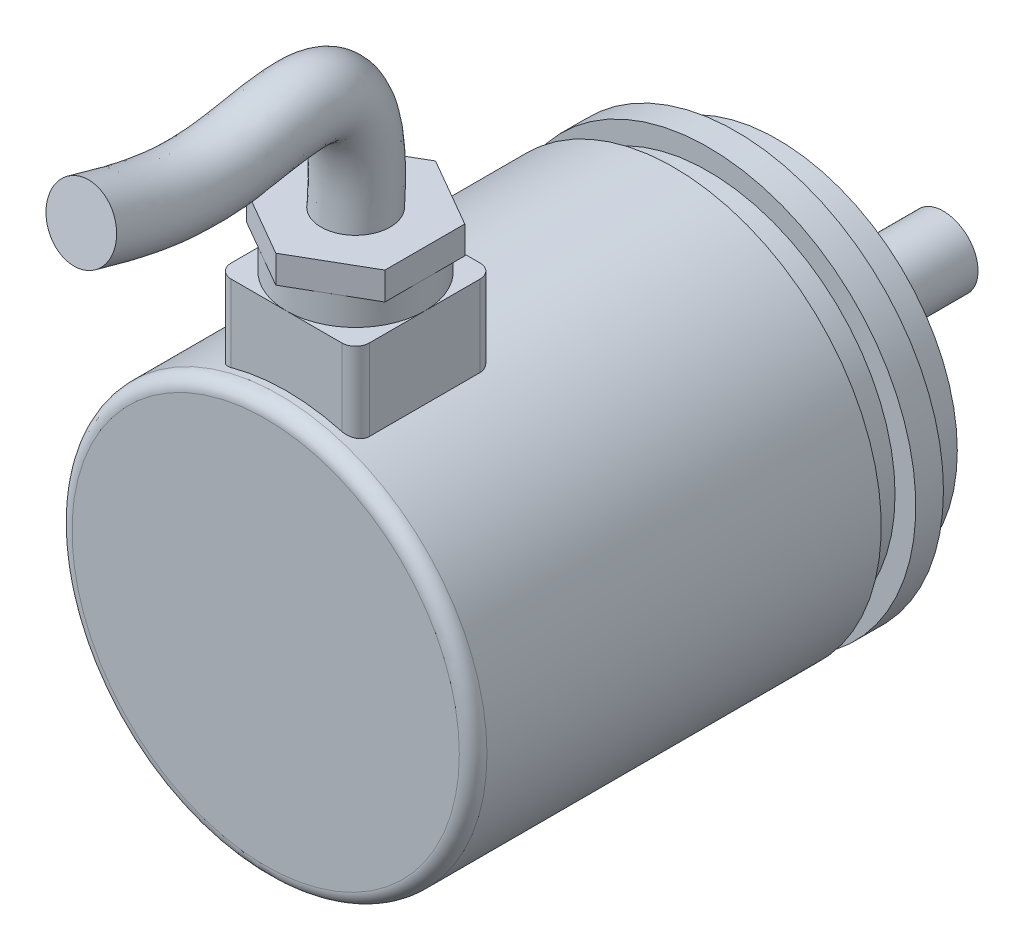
ISO-10303-21;
HEADER;
FILE_DESCRIPTION(('STEP AP214'),'2;1');
FILE_NAME('part.step','',(''),(''),'','','');
FILE_SCHEMA(('AUTOMOTIVE_DESIGN { 1 0 10303 214 1 1 1 1 }'));
ENDSEC;
DATA;
#1=APPLICATION_CONTEXT('core data for automotive mechanical design processes');
#2=APPLICATION_PROTOCOL_DEFINITION('international standard','automotive_design',2000,#1);
#3=PRODUCT_CONTEXT('',#1,'mechanical');
#4=PRODUCT('Part','Part','',(#3));
#5=PRODUCT_RELATED_PRODUCT_CATEGORY('part','',(#4));
#6=PRODUCT_DEFINITION_FORMATION('','',#4);
#7=PRODUCT_DEFINITION_CONTEXT('part definition',#1,'design');
#8=PRODUCT_DEFINITION('design','',#6,#7);
#9=PRODUCT_DEFINITION_SHAPE('','',#8);
#10=(LENGTH_UNIT() NAMED_UNIT(*) SI_UNIT(.MILLI.,.METRE.));
#11=(NAMED_UNIT(*) PLANE_ANGLE_UNIT() SI_UNIT($,.RADIAN.));
#12=(NAMED_UNIT(*) SI_UNIT($,.STERADIAN.) SOLID_ANGLE_UNIT());
#13=UNCERTAINTY_MEASURE_WITH_UNIT(LENGTH_MEASURE(1.E-05),#10,'distance_accuracy_value','');
#14=(GEOMETRIC_REPRESENTATION_CONTEXT(3) GLOBAL_UNCERTAINTY_ASSIGNED_CONTEXT((#13)) GLOBAL_UNIT_ASSIGNED_CONTEXT((#10,
#11,#12)) REPRESENTATION_CONTEXT('',''));
#15=CARTESIAN_POINT('',(0.,0.,0.));
#16=DIRECTION('',(0.,0.,1.));
#17=DIRECTION('',(1.,0.,0.));
#18=AXIS2_PLACEMENT_3D('',#15,#16,#17);
#19=CARTESIAN_POINT('',(2.78567965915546E-13,0.,34.));
#20=DIRECTION('',(0.,0.,-1.));
#21=DIRECTION('',(-1.,0.,0.));
#22=AXIS2_PLACEMENT_3D('',#19,#20,#21);
#23=CYLINDRICAL_SURFACE('',#22,15.);
#24=DIRECTION('',(0.,0.,-1.));
#25=VECTOR('',#24,1.);
#26=CARTESIAN_POINT('',(-4.99999999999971,14.1421356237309,34.));
#27=LINE('',#26,#25);
#28=CARTESIAN_POINT('',(-4.99999999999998,14.1421356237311,23.5000000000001));
#29=VERTEX_POINT('',#28);
#30=CARTESIAN_POINT('',(-4.99999999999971,14.1421356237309,31.5000000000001));
#31=VERTEX_POINT('',#30);
#32=EDGE_CURVE('E598',#29,#31,#27,.F.);
#33=ORIENTED_EDGE('',*,*,#32,.F.);
#34=CARTESIAN_POINT('',(-4.99999999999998,14.1421356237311,23.5000000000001));
#35=CARTESIAN_POINT('',(-5.00000064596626,14.1421349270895,23.4729579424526));
#36=CARTESIAN_POINT('',(-4.99890234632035,14.1425237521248,23.445929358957));
#37=CARTESIAN_POINT('',(-4.99452631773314,14.1440699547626,23.3920763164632));
#38=CARTESIAN_POINT('',(-4.99124899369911,14.1452271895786,23.3652518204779));
#39=CARTESIAN_POINT('',(-4.97820486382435,14.1498256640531,23.2855142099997));
#40=CARTESIAN_POINT('',(-4.96522561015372,14.1543938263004,23.2331527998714));
#41=CARTESIAN_POINT('',(-4.93117923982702,14.1662906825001,23.1315137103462));
#42=CARTESIAN_POINT('',(-4.9101135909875,14.173618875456,23.0822354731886));
#43=CARTESIAN_POINT('',(-4.86061441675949,14.1906698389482,22.987967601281));
#44=CARTESIAN_POINT('',(-4.83217837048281,14.2003934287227,22.9429794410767));
#45=CARTESIAN_POINT('',(-4.7679711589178,14.222082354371,22.8572190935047));
#46=CARTESIAN_POINT('',(-4.7320228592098,14.2341010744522,22.8165933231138));
#47=CARTESIAN_POINT('',(-4.65434246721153,14.2596902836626,22.741882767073));
#48=CARTESIAN_POINT('',(-4.61260858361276,14.2732612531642,22.7078000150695));
#49=CARTESIAN_POINT('',(-4.52215740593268,14.3021837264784,22.6452895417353));
#50=CARTESIAN_POINT('',(-4.47318889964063,14.3175912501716,22.617251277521));
#51=CARTESIAN_POINT('',(-4.37140510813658,14.3489948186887,22.5698336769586));
#52=CARTESIAN_POINT('',(-4.31859033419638,14.3649907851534,22.5504531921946));
#53=CARTESIAN_POINT('',(-4.22152266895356,14.3937749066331,22.523824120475));
#54=CARTESIAN_POINT('',(-4.17771582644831,14.4065531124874,22.5149088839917));
#55=CARTESIAN_POINT('',(-4.08929800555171,14.4319018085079,22.5029953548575));
#56=CARTESIAN_POINT('',(-4.04468793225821,14.444472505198,22.4999907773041));
#57=CARTESIAN_POINT('',(-3.99999999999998,14.456832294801,22.5));
#58=B_SPLINE_CURVE_WITH_KNOTS('',3,(#34,#35,#36,#37,#38,#39,#40,#41,#42,#43,#44,#45,#46,#47,#48,
#49,#50,#51,#52,#53,#54,#55,#56,#57),.UNSPECIFIED.,.F.,.F.,(4,2,2,2,2,2,2,2,2,2,2,4),(0.,
0.0810746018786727,0.16213414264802,0.323707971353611,0.485252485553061,0.646852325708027,
0.812810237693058,0.978819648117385,1.15351986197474,1.32819689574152,1.4673107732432,
1.60627664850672),.UNSPECIFIED.);
#59=CARTESIAN_POINT('',(-3.99999999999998,14.456832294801,22.5));
#60=VERTEX_POINT('',#59);
#61=EDGE_CURVE('E832',#29,#60,#58,.T.);
#62=ORIENTED_EDGE('',*,*,#61,.T.);
#63=CARTESIAN_POINT('',(0.,0.,22.5));
#64=DIRECTION('',(0.,0.,1.));
#65=DIRECTION('',(1.,0.,0.));
#66=AXIS2_PLACEMENT_3D('',#63,#64,#65);
#67=CIRCLE('',#66,15.);
#68=CARTESIAN_POINT('',(4.00000000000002,14.456832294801,22.4999999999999));
#69=VERTEX_POINT('',#68);
#70=EDGE_CURVE('E590',#69,#60,#67,.T.);
#71=ORIENTED_EDGE('',*,*,#70,.F.);
#72=CARTESIAN_POINT('',(4.00000000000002,14.456832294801,22.4999999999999));
#73=CARTESIAN_POINT('',(4.05847505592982,14.4406676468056,22.4999642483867));
#74=CARTESIAN_POINT('',(4.11682620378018,14.4241266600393,22.5051263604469));
#75=CARTESIAN_POINT('',(4.23169079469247,14.3908393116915,22.5254737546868));
#76=CARTESIAN_POINT('',(4.28820439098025,14.374092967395,22.5406581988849));
#77=CARTESIAN_POINT('',(4.3978370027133,14.3409324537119,22.5806861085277));
#78=CARTESIAN_POINT('',(4.45095460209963,14.3245184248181,22.6055335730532));
#79=CARTESIAN_POINT('',(4.55224457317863,14.2926513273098,22.6642666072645));
#80=CARTESIAN_POINT('',(4.60041815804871,14.2771980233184,22.6981499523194));
#81=CARTESIAN_POINT('',(4.68995119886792,14.2480370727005,22.7737966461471));
#82=CARTESIAN_POINT('',(4.73136829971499,14.2343149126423,22.8154860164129));
#83=CARTESIAN_POINT('',(4.80653330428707,14.2091102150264,22.9058980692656));
#84=CARTESIAN_POINT('',(4.84028113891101,14.1976276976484,22.9546208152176));
#85=CARTESIAN_POINT('',(4.89758307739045,14.1779604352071,23.0555134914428));
#86=CARTESIAN_POINT('',(4.92150966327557,14.1696562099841,23.1074486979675));
#87=CARTESIAN_POINT('',(4.96021362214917,14.1561543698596,23.2149692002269));
#88=CARTESIAN_POINT('',(4.97500397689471,14.1509523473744,23.2705491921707));
#89=CARTESIAN_POINT('',(4.98993944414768,14.1456894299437,23.355559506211));
#90=CARTESIAN_POINT('',(4.99370994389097,14.1443583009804,23.3843206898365));
#91=CARTESIAN_POINT('',(4.99873895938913,14.1425815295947,23.4420493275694));
#92=CARTESIAN_POINT('',(5.00000089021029,14.1421346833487,23.4710164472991));
#93=CARTESIAN_POINT('',(5.00000000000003,14.1421356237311,23.5));
#94=B_SPLINE_CURVE_WITH_KNOTS('',3,(#72,#73,#74,#75,#76,#77,#78,#79,#80,#81,#82,#83,#84,#85,#86,
#87,#88,#89,#90,#91,#92,#93),.UNSPECIFIED.,.F.,.F.,(4,2,2,2,2,2,2,2,2,2,4),(0.,0.18175915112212,
0.36350310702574,0.545322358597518,0.727096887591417,0.907228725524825,1.08736218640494,
1.25983492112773,1.43206202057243,1.51906810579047,1.60595566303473),.UNSPECIFIED.);
#95=CARTESIAN_POINT('',(5.00000000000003,14.1421356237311,23.5));
#96=VERTEX_POINT('',#95);
#97=EDGE_CURVE('E837',#69,#96,#94,.T.);
#98=ORIENTED_EDGE('',*,*,#97,.T.);
#99=DIRECTION('',(0.,0.,-1.));
#100=VECTOR('',#99,1.);
#101=CARTESIAN_POINT('',(5.0000000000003,14.142135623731,34.0000000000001));
#102=LINE('',#101,#100);
#103=CARTESIAN_POINT('',(5.0000000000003,14.142135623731,31.5000000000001));
#104=VERTEX_POINT('',#103);
#105=EDGE_CURVE('E593',#104,#96,#102,.T.);
#106=ORIENTED_EDGE('',*,*,#105,.F.);
#107=CARTESIAN_POINT('',(5.0000000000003,14.142135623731,31.5000000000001));
#108=CARTESIAN_POINT('',(5.00000064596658,14.1421349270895,31.5270420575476));
#109=CARTESIAN_POINT('',(4.99890234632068,14.1425237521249,31.5540706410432));
#110=CARTESIAN_POINT('',(4.99452631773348,14.1440699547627,31.6079236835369));
#111=CARTESIAN_POINT('',(4.99124899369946,14.1452271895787,31.6347481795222));
#112=CARTESIAN_POINT('',(4.9782048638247,14.1498256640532,31.7144857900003));
#113=CARTESIAN_POINT('',(4.96522561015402,14.1543938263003,31.7668472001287));
#114=CARTESIAN_POINT('',(4.93117923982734,14.1662906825,31.8684862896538));
#115=CARTESIAN_POINT('',(4.91011359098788,14.1736188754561,31.9177645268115));
#116=CARTESIAN_POINT('',(4.86061441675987,14.1906698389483,32.0120323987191));
#117=CARTESIAN_POINT('',(4.83217837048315,14.2003934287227,32.0570205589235));
#118=CARTESIAN_POINT('',(4.76797115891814,14.222082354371,32.1427809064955));
#119=CARTESIAN_POINT('',(4.7320228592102,14.2341010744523,32.1834066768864));
#120=CARTESIAN_POINT('',(4.65434246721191,14.2596902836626,32.2581172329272));
#121=CARTESIAN_POINT('',(4.61260858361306,14.2732612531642,32.2921999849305));
#122=CARTESIAN_POINT('',(4.522157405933,14.3021837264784,32.3547104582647));
#123=CARTESIAN_POINT('',(4.47318889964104,14.3175912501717,32.3827487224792));
#124=CARTESIAN_POINT('',(4.371405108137,14.3489948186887,32.4301663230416));
#125=CARTESIAN_POINT('',(4.31859033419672,14.3649907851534,32.4495468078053));
#126=CARTESIAN_POINT('',(4.22152266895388,14.3937749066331,32.476175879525));
#127=CARTESIAN_POINT('',(4.17771582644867,14.4065531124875,32.4850911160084));
#128=CARTESIAN_POINT('',(4.08929800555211,14.4319018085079,32.4970046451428));
#129=CARTESIAN_POINT('',(4.04468793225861,14.444472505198,32.5000092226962));
#130=CARTESIAN_POINT('',(4.00000000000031,14.456832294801,32.5));
#131=B_SPLINE_CURVE_WITH_KNOTS('',3,(#107,#108,#109,#110,#111,#112,#113,#114,#115,#116,#117,
#118,#119,#120,#121,#122,#123,#124,#125,#126,#127,#128,#129,#130),.UNSPECIFIED.,.F.,.F.,(4,2,2,
2,2,2,2,2,2,2,2,4),(0.,0.0810746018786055,0.162134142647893,0.323707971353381,0.485252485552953,
0.64685232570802,0.812810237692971,0.978819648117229,1.15351986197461,1.3281968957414,
1.46731077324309,1.60627664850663),.UNSPECIFIED.);
#132=CARTESIAN_POINT('',(4.00000000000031,14.456832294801,32.5));
#133=VERTEX_POINT('',#132);
#134=EDGE_CURVE('E11',#104,#133,#131,.T.);
#135=ORIENTED_EDGE('',*,*,#134,.T.);
#136=CARTESIAN_POINT('',(2.78523309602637E-13,0.,32.5));
#137=DIRECTION('',(0.,0.,-1.));
#138=DIRECTION('',(-1.,0.,0.));
#139=AXIS2_PLACEMENT_3D('',#136,#137,#138);
#140=CIRCLE('',#139,15.);
#141=CARTESIAN_POINT('',(-3.9999999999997,14.456832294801,32.5));
#142=VERTEX_POINT('',#141);
#143=EDGE_CURVE('E596',#142,#133,#140,.T.);
#144=ORIENTED_EDGE('',*,*,#143,.F.);
#145=CARTESIAN_POINT('',(-3.9999999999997,14.456832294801,32.5));
#146=CARTESIAN_POINT('',(-4.0584750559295,14.4406676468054,32.5000357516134));
#147=CARTESIAN_POINT('',(-4.11682620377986,14.4241266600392,32.4948736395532));
#148=CARTESIAN_POINT('',(-4.23169079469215,14.3908393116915,32.4745262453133));
#149=CARTESIAN_POINT('',(-4.28820439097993,14.3740929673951,32.4593418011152));
#150=CARTESIAN_POINT('',(-4.397837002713,14.3409324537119,32.4193138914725));
#151=CARTESIAN_POINT('',(-4.45095460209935,14.324518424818,32.3944664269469));
#152=CARTESIAN_POINT('',(-4.55224457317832,14.2926513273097,32.3357333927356));
#153=CARTESIAN_POINT('',(-4.60041815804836,14.2771980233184,32.3018500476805));
#154=CARTESIAN_POINT('',(-4.68995119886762,14.2480370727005,32.2262033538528));
#155=CARTESIAN_POINT('',(-4.73136829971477,14.2343149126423,32.1845139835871));
#156=CARTESIAN_POINT('',(-4.80653330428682,14.2091102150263,32.0941019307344));
#157=CARTESIAN_POINT('',(-4.84028113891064,14.1976276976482,32.0453791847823));
#158=CARTESIAN_POINT('',(-4.89758307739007,14.1779604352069,31.9444865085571));
#159=CARTESIAN_POINT('',(-4.9215096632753,14.169656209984,31.8925513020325));
#160=CARTESIAN_POINT('',(-4.96021362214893,14.1561543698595,31.785030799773));
#161=CARTESIAN_POINT('',(-4.97500397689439,14.1509523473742,31.7294508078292));
#162=CARTESIAN_POINT('',(-4.98993944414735,14.1456894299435,31.6444404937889));
#163=CARTESIAN_POINT('',(-4.99370994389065,14.1443583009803,31.6156793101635));
#164=CARTESIAN_POINT('',(-4.99873895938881,14.1425815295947,31.5579506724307));
#165=CARTESIAN_POINT('',(-5.00000089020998,14.1421346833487,31.528983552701));
#166=CARTESIAN_POINT('',(-4.99999999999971,14.1421356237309,31.5000000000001));
#167=B_SPLINE_CURVE_WITH_KNOTS('',3,(#145,#146,#147,#148,#149,#150,#151,#152,#153,#154,#155,
#156,#157,#158,#159,#160,#161,#162,#163,#164,#165,#166),.UNSPECIFIED.,.F.,.F.,(4,2,2,2,2,2,2,2,
2,2,4),(0.,0.181759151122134,0.363503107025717,0.545322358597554,0.727096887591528,
0.907228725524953,1.08736218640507,1.25983492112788,1.43206202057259,1.51906810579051,
1.60595566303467),.UNSPECIFIED.);
#168=EDGE_CURVE('E360',#142,#31,#167,.T.);
#169=ORIENTED_EDGE('',*,*,#168,.T.);
#170=EDGE_LOOP('',(#33,#62,#71,#98,#106,#135,#144,#169));
#171=FACE_BOUND('',#170,.T.);
#172=CARTESIAN_POINT('',(2.78538195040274E-13,0.,32.9999999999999));
#173=DIRECTION('',(0.,0.,1.));
#174=DIRECTION('',(1.,0.,0.));
#175=AXIS2_PLACEMENT_3D('',#172,#173,#174);
#176=CIRCLE('',#175,15.);
#177=CARTESIAN_POINT('',(15.0000000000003,0.,32.9999999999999));
#178=VERTEX_POINT('',#177);
#179=EDGE_CURVE('E587',#178,#178,#176,.F.);
#180=ORIENTED_EDGE('',*,*,#179,.T.);
#181=EDGE_LOOP('',(#180));
#182=FACE_BOUND('',#181,.T.);
#183=CARTESIAN_POINT('',(0.,0.,4.49999999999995));
#184=DIRECTION('',(0.,0.,-1.));
#185=DIRECTION('',(-1.,0.,0.));
#186=AXIS2_PLACEMENT_3D('',#183,#184,#185);
#187=CIRCLE('',#186,15.);
#188=CARTESIAN_POINT('',(-15.,0.,4.49999999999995));
#189=VERTEX_POINT('',#188);
#190=EDGE_CURVE('E759',#189,#189,#187,.T.);
#191=ORIENTED_EDGE('',*,*,#190,.F.);
#192=EDGE_LOOP('',(#191));
#193=FACE_BOUND('',#192,.T.);
#194=ADVANCED_FACE('F348',(#171,#182,#193),#23,.T.);
#195=CARTESIAN_POINT('',(3.11958701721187E-13,22.,27.5000000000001));
#196=DIRECTION('',(0.,1.,0.));
#197=DIRECTION('',(0.,0.,1.));
#198=AXIS2_PLACEMENT_3D('',#195,#196,#197);
#199=PLANE('',#198);
#200=DIRECTION('',(0.866025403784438,0.,-0.5));
#201=VECTOR('',#200,1.);
#202=CARTESIAN_POINT('',(3.12130415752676E-13,22.,33.2678529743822));
#203=LINE('',#202,#201);
#204=CARTESIAN_POINT('',(2.30603849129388,22.,31.936461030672));
#205=VERTEX_POINT('',#204);
#206=CARTESIAN_POINT('',(2.68906870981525,22.,31.7153184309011));
#207=VERTEX_POINT('',#206);
#208=EDGE_CURVE('E896',#205,#207,#203,.T.);
#209=ORIENTED_EDGE('',*,*,#208,.F.);
#210=CARTESIAN_POINT('',(3.11958701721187E-13,22.,27.5000000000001));
#211=DIRECTION('',(0.,1.,0.));
#212=DIRECTION('',(0.,0.,1.));
#213=AXIS2_PLACEMENT_3D('',#210,#211,#212);
#214=CIRCLE('',#213,5.);
#215=EDGE_CURVE('E535',#205,#207,#214,.T.);
#216=ORIENTED_EDGE('',*,*,#215,.T.);
#217=EDGE_LOOP('',(#209,#216));
#218=FACE_BOUND('',#217,.T.);
#219=ADVANCED_FACE('F650',(#218),#199,.T.);
#220=CARTESIAN_POINT('',(-4.99999999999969,20.,32.5));
#221=DIRECTION('',(0.,1.,0.));
#222=DIRECTION('',(0.,0.,1.));
#223=AXIS2_PLACEMENT_3D('',#220,#221,#222);
#224=PLANE('',#223);
#225=DIRECTION('',(1.,0.,0.));
#226=VECTOR('',#225,1.);
#227=CARTESIAN_POINT('',(-4.99999999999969,20.,32.5));
#228=LINE('',#227,#226);
#229=CARTESIAN_POINT('',(3.09054442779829E-13,20.,32.5));
#230=VERTEX_POINT('',#229);
#231=CARTESIAN_POINT('',(4.00000000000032,20.0000000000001,32.5));
#232=VERTEX_POINT('',#231);
#233=EDGE_CURVE('E542',#230,#232,#228,.T.);
#234=ORIENTED_EDGE('',*,*,#233,.T.);
#235=CARTESIAN_POINT('',(4.00000000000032,20.,31.5000000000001));
#236=DIRECTION('',(0.,1.,0.));
#237=DIRECTION('',(0.,0.,1.));
#238=AXIS2_PLACEMENT_3D('',#235,#236,#237);
#239=CIRCLE('',#238,1.);
#240=CARTESIAN_POINT('',(5.00000000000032,20.0000000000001,31.5000000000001));
#241=VERTEX_POINT('',#240);
#242=EDGE_CURVE('E830',#232,#241,#239,.T.);
#243=ORIENTED_EDGE('',*,*,#242,.T.);
#244=DIRECTION('',(0.,0.,-1.));
#245=VECTOR('',#244,1.);
#246=CARTESIAN_POINT('',(5.00000000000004,20.0000000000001,22.5));
#247=LINE('',#246,#245);
#248=CARTESIAN_POINT('',(5.00000000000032,20.0000000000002,27.5000000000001));
#249=VERTEX_POINT('',#248);
#250=EDGE_CURVE('E546',#241,#249,#247,.T.);
#251=ORIENTED_EDGE('',*,*,#250,.T.);
#252=CARTESIAN_POINT('',(3.08905588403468E-13,20.,27.5000000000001));
#253=DIRECTION('',(0.,1.,0.));
#254=DIRECTION('',(0.,0.,1.));
#255=AXIS2_PLACEMENT_3D('',#252,#253,#254);
#256=CIRCLE('',#255,5.);
#257=EDGE_CURVE('E522',#230,#249,#256,.T.);
#258=ORIENTED_EDGE('',*,*,#257,.F.);
#259=EDGE_LOOP('',(#234,#243,#251,#258));
#260=FACE_BOUND('',#259,.T.);
#261=ADVANCED_FACE('F658',(#260),#224,.T.);
#262=CARTESIAN_POINT('',(5.00000000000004,20.0000000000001,23.5000000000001));
#263=VERTEX_POINT('',#262);
#264=EDGE_CURVE('E545',#249,#263,#247,.T.);
#265=ORIENTED_EDGE('',*,*,#264,.T.);
#266=CARTESIAN_POINT('',(4.00000000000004,20.,23.5));
#267=DIRECTION('',(0.,1.,0.));
#268=DIRECTION('',(0.,0.,1.));
#269=AXIS2_PLACEMENT_3D('',#266,#267,#268);
#270=CIRCLE('',#269,1.);
#271=CARTESIAN_POINT('',(4.00000000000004,20.,22.4999999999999));
#272=VERTEX_POINT('',#271);
#273=EDGE_CURVE('E823',#263,#272,#270,.T.);
#274=ORIENTED_EDGE('',*,*,#273,.T.);
#275=DIRECTION('',(-1.,0.,0.));
#276=VECTOR('',#275,1.);
#277=CARTESIAN_POINT('',(-4.99999999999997,20.0000000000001,22.5));
#278=LINE('',#277,#276);
#279=CARTESIAN_POINT('',(0.,20.,22.5));
#280=VERTEX_POINT('',#279);
#281=EDGE_CURVE('E549',#272,#280,#278,.T.);
#282=ORIENTED_EDGE('',*,*,#281,.T.);
#283=EDGE_CURVE('E528',#249,#280,#256,.T.);
#284=ORIENTED_EDGE('',*,*,#283,.F.);
#285=EDGE_LOOP('',(#265,#274,#282,#284));
#286=FACE_BOUND('',#285,.T.);
#287=ADVANCED_FACE('F729',(#286),#224,.T.);
#288=CARTESIAN_POINT('',(-3.99999999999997,20.,22.5));
#289=VERTEX_POINT('',#288);
#290=EDGE_CURVE('E548',#280,#289,#278,.T.);
#291=ORIENTED_EDGE('',*,*,#290,.T.);
#292=CARTESIAN_POINT('',(-3.99999999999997,20.,23.5000000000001));
#293=DIRECTION('',(0.,1.,0.));
#294=DIRECTION('',(0.,0.,1.));
#295=AXIS2_PLACEMENT_3D('',#292,#293,#294);
#296=CIRCLE('',#295,1.);
#297=CARTESIAN_POINT('',(-4.99999999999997,20.0000000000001,23.5000000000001));
#298=VERTEX_POINT('',#297);
#299=EDGE_CURVE('E807',#289,#298,#296,.T.);
#300=ORIENTED_EDGE('',*,*,#299,.T.);
#301=DIRECTION('',(0.,0.,1.));
#302=VECTOR('',#301,1.);
#303=CARTESIAN_POINT('',(-4.99999999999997,20.0000000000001,22.5));
#304=LINE('',#303,#302);
#305=CARTESIAN_POINT('',(-4.99999999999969,20.,27.5000000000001));
#306=VERTEX_POINT('',#305);
#307=EDGE_CURVE('E540',#298,#306,#304,.T.);
#308=ORIENTED_EDGE('',*,*,#307,.T.);
#309=EDGE_CURVE('E894',#280,#306,#256,.T.);
#310=ORIENTED_EDGE('',*,*,#309,.F.);
#311=EDGE_LOOP('',(#291,#300,#308,#310));
#312=FACE_BOUND('',#311,.T.);
#313=ADVANCED_FACE('F659',(#312),#224,.T.);
#314=CARTESIAN_POINT('',(2.78567965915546E-13,0.,34.));
#315=DIRECTION('',(0.,0.,1.));
#316=DIRECTION('',(1.,0.,0.));
#317=AXIS2_PLACEMENT_3D('',#314,#315,#316);
#318=PLANE('',#317);
#319=CARTESIAN_POINT('',(2.78567965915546E-13,0.,34.));
#320=DIRECTION('',(0.,0.,1.));
#321=DIRECTION('',(1.,0.,0.));
#322=AXIS2_PLACEMENT_3D('',#319,#320,#321);
#323=CIRCLE('',#322,14.);
#324=CARTESIAN_POINT('',(14.0000000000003,0.,34.));
#325=VERTEX_POINT('',#324);
#326=EDGE_CURVE('E584',#325,#325,#323,.T.);
#327=ORIENTED_EDGE('',*,*,#326,.T.);
#328=EDGE_LOOP('',(#327));
#329=FACE_BOUND('',#328,.T.);
#330=ADVANCED_FACE('F704',(#329),#318,.T.);
#331=CARTESIAN_POINT('',(2.78538195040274E-13,0.,32.9999999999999));
#332=DIRECTION('',(0.,0.,1.));
#333=DIRECTION('',(1.,0.,0.));
#334=AXIS2_PLACEMENT_3D('',#331,#332,#333);
#335=TOROIDAL_SURFACE('',#334,14.,1.);
#336=ORIENTED_EDGE('',*,*,#179,.F.);
#337=EDGE_LOOP('',(#336));
#338=FACE_BOUND('',#337,.T.);
#339=ORIENTED_EDGE('',*,*,#326,.F.);
#340=EDGE_LOOP('',(#339));
#341=FACE_BOUND('',#340,.T.);
#342=ADVANCED_FACE('F673',(#338,#341),#335,.T.);
#343=CARTESIAN_POINT('',(-4.99999999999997,20.0000000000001,22.5));
#344=DIRECTION('',(1.,0.,0.));
#345=DIRECTION('',(0.,0.,-1.));
#346=AXIS2_PLACEMENT_3D('',#343,#344,#345);
#347=PLANE('',#346);
#348=ORIENTED_EDGE('',*,*,#307,.F.);
#349=DIRECTION('',(0.,-1.,0.));
#350=VECTOR('',#349,1.);
#351=CARTESIAN_POINT('',(-4.99999999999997,20.0000000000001,23.5000000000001));
#352=LINE('',#351,#350);
#353=EDGE_CURVE('E810',#298,#29,#352,.T.);
#354=ORIENTED_EDGE('',*,*,#353,.T.);
#355=ORIENTED_EDGE('',*,*,#32,.T.);
#356=DIRECTION('',(0.,-1.,0.));
#357=VECTOR('',#356,1.);
#358=CARTESIAN_POINT('',(-4.99999999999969,20.,31.5000000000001));
#359=LINE('',#358,#357);
#360=CARTESIAN_POINT('',(-4.99999999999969,20.,31.5000000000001));
#361=VERTEX_POINT('',#360);
#362=EDGE_CURVE('E610',#31,#361,#359,.F.);
#363=ORIENTED_EDGE('',*,*,#362,.T.);
#364=EDGE_CURVE('E538',#306,#361,#304,.T.);
#365=ORIENTED_EDGE('',*,*,#364,.F.);
#366=EDGE_LOOP('',(#348,#354,#355,#363,#365));
#367=FACE_BOUND('',#366,.T.);
#368=ADVANCED_FACE('F670',(#367),#347,.F.);
#369=CARTESIAN_POINT('',(-4.99999999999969,20.,32.5));
#370=DIRECTION('',(0.,0.,-1.));
#371=DIRECTION('',(-1.,0.,0.));
#372=AXIS2_PLACEMENT_3D('',#369,#370,#371);
#373=PLANE('',#372);
#374=CARTESIAN_POINT('',(-3.99999999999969,20.,32.5));
#375=VERTEX_POINT('',#374);
#376=EDGE_CURVE('E543',#375,#230,#228,.T.);
#377=ORIENTED_EDGE('',*,*,#376,.F.);
#378=DIRECTION('',(0.,-1.,0.));
#379=VECTOR('',#378,1.);
#380=CARTESIAN_POINT('',(-3.99999999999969,20.,32.5));
#381=LINE('',#380,#379);
#382=EDGE_CURVE('E826',#375,#142,#381,.T.);
#383=ORIENTED_EDGE('',*,*,#382,.T.);
#384=ORIENTED_EDGE('',*,*,#143,.T.);
#385=DIRECTION('',(0.,-1.,0.));
#386=VECTOR('',#385,1.);
#387=CARTESIAN_POINT('',(4.00000000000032,20.0000000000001,32.5));
#388=LINE('',#387,#386);
#389=EDGE_CURVE('E375',#133,#232,#388,.F.);
#390=ORIENTED_EDGE('',*,*,#389,.T.);
#391=ORIENTED_EDGE('',*,*,#233,.F.);
#392=EDGE_LOOP('',(#377,#383,#384,#390,#391));
#393=FACE_BOUND('',#392,.T.);
#394=ADVANCED_FACE('F666',(#393),#373,.F.);
#395=CARTESIAN_POINT('',(5.00000000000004,20.0000000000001,22.5));
#396=DIRECTION('',(-1.,0.,0.));
#397=DIRECTION('',(0.,0.,1.));
#398=AXIS2_PLACEMENT_3D('',#395,#396,#397);
#399=PLANE('',#398);
#400=ORIENTED_EDGE('',*,*,#105,.T.);
#401=DIRECTION('',(0.,-1.,0.));
#402=VECTOR('',#401,1.);
#403=CARTESIAN_POINT('',(5.00000000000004,20.0000000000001,23.5000000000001));
#404=LINE('',#403,#402);
#405=EDGE_CURVE('E816',#96,#263,#404,.F.);
#406=ORIENTED_EDGE('',*,*,#405,.T.);
#407=ORIENTED_EDGE('',*,*,#264,.F.);
#408=ORIENTED_EDGE('',*,*,#250,.F.);
#409=DIRECTION('',(0.,-1.,0.));
#410=VECTOR('',#409,1.);
#411=CARTESIAN_POINT('',(5.00000000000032,20.0000000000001,31.5000000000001));
#412=LINE('',#411,#410);
#413=EDGE_CURVE('E813',#241,#104,#412,.T.);
#414=ORIENTED_EDGE('',*,*,#413,.T.);
#415=EDGE_LOOP('',(#400,#406,#407,#408,#414));
#416=FACE_BOUND('',#415,.T.);
#417=ADVANCED_FACE('F662',(#416),#399,.F.);
#418=CARTESIAN_POINT('',(-4.99999999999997,20.0000000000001,22.5));
#419=DIRECTION('',(0.,0.,1.));
#420=DIRECTION('',(1.,0.,0.));
#421=AXIS2_PLACEMENT_3D('',#418,#419,#420);
#422=PLANE('',#421);
#423=ORIENTED_EDGE('',*,*,#70,.T.);
#424=DIRECTION('',(0.,-1.,0.));
#425=VECTOR('',#424,1.);
#426=CARTESIAN_POINT('',(-3.99999999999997,20.,22.5));
#427=LINE('',#426,#425);
#428=EDGE_CURVE('E808',#60,#289,#427,.F.);
#429=ORIENTED_EDGE('',*,*,#428,.T.);
#430=ORIENTED_EDGE('',*,*,#290,.F.);
#431=ORIENTED_EDGE('',*,*,#281,.F.);
#432=DIRECTION('',(0.,-1.,0.));
#433=VECTOR('',#432,1.);
#434=CARTESIAN_POINT('',(4.00000000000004,20.,22.4999999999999));
#435=LINE('',#434,#433);
#436=EDGE_CURVE('E818',#272,#69,#435,.T.);
#437=ORIENTED_EDGE('',*,*,#436,.T.);
#438=EDGE_LOOP('',(#423,#429,#430,#431,#437));
#439=FACE_BOUND('',#438,.T.);
#440=ADVANCED_FACE('F657',(#439),#422,.F.);
#441=ORIENTED_EDGE('',*,*,#364,.T.);
#442=CARTESIAN_POINT('',(-3.99999999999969,20.,31.5000000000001));
#443=DIRECTION('',(0.,1.,0.));
#444=DIRECTION('',(0.,0.,1.));
#445=AXIS2_PLACEMENT_3D('',#442,#443,#444);
#446=CIRCLE('',#445,1.);
#447=EDGE_CURVE('E367',#361,#375,#446,.T.);
#448=ORIENTED_EDGE('',*,*,#447,.T.);
#449=ORIENTED_EDGE('',*,*,#376,.T.);
#450=EDGE_CURVE('E529',#306,#230,#256,.T.);
#451=ORIENTED_EDGE('',*,*,#450,.F.);
#452=EDGE_LOOP('',(#441,#448,#449,#451));
#453=FACE_BOUND('',#452,.T.);
#454=ADVANCED_FACE('F653',(#453),#224,.T.);
#455=CARTESIAN_POINT('',(3.11958701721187E-13,22.,27.5000000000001));
#456=DIRECTION('',(0.,-1.,0.));
#457=DIRECTION('',(0.,0.,-1.));
#458=AXIS2_PLACEMENT_3D('',#455,#456,#457);
#459=CYLINDRICAL_SURFACE('',#458,5.);
#460=ORIENTED_EDGE('',*,*,#215,.F.);
#461=CARTESIAN_POINT('',(-2.30603849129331,22.0000000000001,31.936461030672));
#462=VERTEX_POINT('',#461);
#463=EDGE_CURVE('E526',#462,#205,#214,.T.);
#464=ORIENTED_EDGE('',*,*,#463,.F.);
#465=CARTESIAN_POINT('',(-2.68906870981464,22.0000000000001,31.7153184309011));
#466=VERTEX_POINT('',#465);
#467=EDGE_CURVE('E954',#466,#462,#214,.T.);
#468=ORIENTED_EDGE('',*,*,#467,.F.);
#469=CARTESIAN_POINT('',(-4.99999999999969,22.,27.5000000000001));
#470=VERTEX_POINT('',#469);
#471=EDGE_CURVE('E511',#470,#466,#214,.T.);
#472=ORIENTED_EDGE('',*,*,#471,.F.);
#473=CARTESIAN_POINT('',(5.00000000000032,22.0000000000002,27.5000000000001));
#474=VERTEX_POINT('',#473);
#475=EDGE_CURVE('E943',#474,#470,#214,.T.);
#476=ORIENTED_EDGE('',*,*,#475,.F.);
#477=EDGE_CURVE('E539',#207,#474,#214,.T.);
#478=ORIENTED_EDGE('',*,*,#477,.F.);
#479=EDGE_LOOP('',(#460,#464,#468,#472,#476,#478));
#480=FACE_BOUND('',#479,.T.);
#481=ORIENTED_EDGE('',*,*,#257,.T.);
#482=ORIENTED_EDGE('',*,*,#283,.T.);
#483=ORIENTED_EDGE('',*,*,#309,.T.);
#484=ORIENTED_EDGE('',*,*,#450,.T.);
#485=EDGE_LOOP('',(#481,#482,#483,#484));
#486=FACE_BOUND('',#485,.T.);
#487=ADVANCED_FACE('F648',(#480,#486),#459,.T.);
#488=DIRECTION('',(0.866025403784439,0.,0.5));
#489=VECTOR('',#488,1.);
#490=CARTESIAN_POINT('',(-4.99999999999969,22.,30.3811016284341));
#491=LINE('',#490,#489);
#492=EDGE_CURVE('E517',#466,#462,#491,.T.);
#493=ORIENTED_EDGE('',*,*,#492,.F.);
#494=ORIENTED_EDGE('',*,*,#467,.T.);
#495=EDGE_LOOP('',(#493,#494));
#496=FACE_BOUND('',#495,.T.);
#497=ADVANCED_FACE('F644',(#496),#199,.T.);
#498=CARTESIAN_POINT('',(-4.99999999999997,22.0000000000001,24.6075989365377));
#499=DIRECTION('',(0.,-1.,0.));
#500=DIRECTION('',(0.,0.,-1.));
#501=AXIS2_PLACEMENT_3D('',#498,#499,#500);
#502=PLANE('',#501);
#503=CARTESIAN_POINT('',(5.00000000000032,22.0000000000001,30.3811016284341));
#504=VERTEX_POINT('',#503);
#505=EDGE_CURVE('E514',#207,#504,#203,.T.);
#506=ORIENTED_EDGE('',*,*,#505,.F.);
#507=ORIENTED_EDGE('',*,*,#477,.T.);
#508=DIRECTION('',(0.,0.,-1.));
#509=VECTOR('',#508,1.);
#510=CARTESIAN_POINT('',(5.00000000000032,22.0000000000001,30.3811016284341));
#511=LINE('',#510,#509);
#512=EDGE_CURVE('E909',#504,#474,#511,.T.);
#513=ORIENTED_EDGE('',*,*,#512,.F.);
#514=EDGE_LOOP('',(#506,#507,#513));
#515=FACE_BOUND('',#514,.T.);
#516=ADVANCED_FACE('F647',(#515),#502,.T.);
#517=CARTESIAN_POINT('',(5.00000000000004,22.0000000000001,24.6075989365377));
#518=VERTEX_POINT('',#517);
#519=EDGE_CURVE('E908',#474,#518,#511,.T.);
#520=ORIENTED_EDGE('',*,*,#519,.F.);
#521=ORIENTED_EDGE('',*,*,#475,.T.);
#522=DIRECTION('',(0.,0.,1.));
#523=VECTOR('',#522,1.);
#524=CARTESIAN_POINT('',(-4.99999999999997,22.0000000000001,24.6075989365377));
#525=LINE('',#524,#523);
#526=CARTESIAN_POINT('',(-4.99999999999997,22.0000000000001,24.6075989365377));
#527=VERTEX_POINT('',#526);
#528=EDGE_CURVE('E503',#527,#470,#525,.T.);
#529=ORIENTED_EDGE('',*,*,#528,.F.);
#530=DIRECTION('',(-0.866025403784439,0.,0.5));
#531=VECTOR('',#530,1.);
#532=CARTESIAN_POINT('',(0.,22.,21.7208475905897));
#533=LINE('',#532,#531);
#534=CARTESIAN_POINT('',(0.,22.,21.7208475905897));
#535=VERTEX_POINT('',#534);
#536=EDGE_CURVE('E915',#535,#527,#533,.T.);
#537=ORIENTED_EDGE('',*,*,#536,.F.);
#538=DIRECTION('',(-0.866025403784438,0.,-0.5));
#539=VECTOR('',#538,1.);
#540=CARTESIAN_POINT('',(5.00000000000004,22.0000000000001,24.6075989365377));
#541=LINE('',#540,#539);
#542=EDGE_CURVE('E913',#518,#535,#541,.T.);
#543=ORIENTED_EDGE('',*,*,#542,.F.);
#544=EDGE_LOOP('',(#520,#521,#529,#537,#543));
#545=FACE_BOUND('',#544,.T.);
#546=ADVANCED_FACE('F947',(#545),#502,.T.);
#547=CARTESIAN_POINT('',(-4.99999999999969,22.,30.3811016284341));
#548=VERTEX_POINT('',#547);
#549=EDGE_CURVE('E495',#470,#548,#525,.T.);
#550=ORIENTED_EDGE('',*,*,#549,.F.);
#551=ORIENTED_EDGE('',*,*,#471,.T.);
#552=EDGE_CURVE('E509',#548,#466,#491,.T.);
#553=ORIENTED_EDGE('',*,*,#552,.F.);
#554=EDGE_LOOP('',(#550,#551,#553));
#555=FACE_BOUND('',#554,.T.);
#556=ADVANCED_FACE('F510',(#555),#502,.T.);
#557=CARTESIAN_POINT('',(-4.99999999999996,24.0000000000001,24.6075989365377));
#558=DIRECTION('',(1.,0.,0.));
#559=DIRECTION('',(0.,0.,-1.));
#560=AXIS2_PLACEMENT_3D('',#557,#558,#559);
#561=PLANE('',#560);
#562=ORIENTED_EDGE('',*,*,#528,.T.);
#563=ORIENTED_EDGE('',*,*,#549,.T.);
#564=DIRECTION('',(0.,-1.,0.));
#565=VECTOR('',#564,1.);
#566=CARTESIAN_POINT('',(-4.99999999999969,24.,30.3811016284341));
#567=LINE('',#566,#565);
#568=CARTESIAN_POINT('',(-4.99999999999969,24.,30.3811016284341));
#569=VERTEX_POINT('',#568);
#570=EDGE_CURVE('E500',#569,#548,#567,.T.);
#571=ORIENTED_EDGE('',*,*,#570,.F.);
#572=DIRECTION('',(0.,0.,1.));
#573=VECTOR('',#572,1.);
#574=CARTESIAN_POINT('',(-4.99999999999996,24.0000000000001,24.6075989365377));
#575=LINE('',#574,#573);
#576=CARTESIAN_POINT('',(-4.99999999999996,24.0000000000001,24.6075989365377));
#577=VERTEX_POINT('',#576);
#578=EDGE_CURVE('E917',#577,#569,#575,.T.);
#579=ORIENTED_EDGE('',*,*,#578,.F.);
#580=DIRECTION('',(0.,-1.,0.));
#581=VECTOR('',#580,1.);
#582=CARTESIAN_POINT('',(-4.99999999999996,24.0000000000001,24.6075989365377));
#583=LINE('',#582,#581);
#584=EDGE_CURVE('E927',#577,#527,#583,.T.);
#585=ORIENTED_EDGE('',*,*,#584,.T.);
#586=EDGE_LOOP('',(#562,#563,#571,#579,#585));
#587=FACE_BOUND('',#586,.T.);
#588=ADVANCED_FACE('F497',(#587),#561,.F.);
#589=CARTESIAN_POINT('',(-4.99999999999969,24.,30.3811016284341));
#590=DIRECTION('',(0.5,0.,-0.866025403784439));
#591=DIRECTION('',(-0.866025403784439,0.,-0.5));
#592=AXIS2_PLACEMENT_3D('',#589,#590,#591);
#593=PLANE('',#592);
#594=ORIENTED_EDGE('',*,*,#552,.T.);
#595=ORIENTED_EDGE('',*,*,#492,.T.);
#596=CARTESIAN_POINT('',(3.12130415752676E-13,22.,33.2678529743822));
#597=VERTEX_POINT('',#596);
#598=EDGE_CURVE('E515',#462,#597,#491,.T.);
#599=ORIENTED_EDGE('',*,*,#598,.T.);
#600=DIRECTION('',(0.,-1.,0.));
#601=VECTOR('',#600,1.);
#602=CARTESIAN_POINT('',(3.15183529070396E-13,24.,33.2678529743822));
#603=LINE('',#602,#601);
#604=CARTESIAN_POINT('',(3.15183529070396E-13,24.,33.2678529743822));
#605=VERTEX_POINT('',#604);
#606=EDGE_CURVE('E523',#605,#597,#603,.T.);
#607=ORIENTED_EDGE('',*,*,#606,.F.);
#608=DIRECTION('',(0.866025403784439,0.,0.5));
#609=VECTOR('',#608,1.);
#610=CARTESIAN_POINT('',(-4.99999999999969,24.,30.3811016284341));
#611=LINE('',#610,#609);
#612=EDGE_CURVE('E520',#569,#605,#611,.T.);
#613=ORIENTED_EDGE('',*,*,#612,.F.);
#614=ORIENTED_EDGE('',*,*,#570,.T.);
#615=EDGE_LOOP('',(#594,#595,#599,#607,#613,#614));
#616=FACE_BOUND('',#615,.T.);
#617=ADVANCED_FACE('F518',(#616),#593,.F.);
#618=CARTESIAN_POINT('',(3.15183529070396E-13,24.,33.2678529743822));
#619=DIRECTION('',(-0.5,0.,-0.866025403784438));
#620=DIRECTION('',(-0.866025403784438,0.,0.5));
#621=AXIS2_PLACEMENT_3D('',#618,#619,#620);
#622=PLANE('',#621);
#623=EDGE_CURVE('E899',#597,#205,#203,.T.);
#624=ORIENTED_EDGE('',*,*,#623,.T.);
#625=ORIENTED_EDGE('',*,*,#208,.T.);
#626=ORIENTED_EDGE('',*,*,#505,.T.);
#627=DIRECTION('',(0.,-1.,0.));
#628=VECTOR('',#627,1.);
#629=CARTESIAN_POINT('',(5.00000000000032,24.0000000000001,30.3811016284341));
#630=LINE('',#629,#628);
#631=CARTESIAN_POINT('',(5.00000000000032,24.0000000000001,30.3811016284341));
#632=VERTEX_POINT('',#631);
#633=EDGE_CURVE('E531',#632,#504,#630,.T.);
#634=ORIENTED_EDGE('',*,*,#633,.F.);
#635=DIRECTION('',(0.866025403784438,0.,-0.5));
#636=VECTOR('',#635,1.);
#637=CARTESIAN_POINT('',(3.15183529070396E-13,24.,33.2678529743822));
#638=LINE('',#637,#636);
#639=EDGE_CURVE('E906',#605,#632,#638,.T.);
#640=ORIENTED_EDGE('',*,*,#639,.F.);
#641=ORIENTED_EDGE('',*,*,#606,.T.);
#642=EDGE_LOOP('',(#624,#625,#626,#634,#640,#641));
#643=FACE_BOUND('',#642,.T.);
#644=ADVANCED_FACE('F635',(#643),#622,.F.);
#645=CARTESIAN_POINT('',(5.00000000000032,24.0000000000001,30.3811016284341));
#646=DIRECTION('',(-1.,0.,0.));
#647=DIRECTION('',(0.,0.,1.));
#648=AXIS2_PLACEMENT_3D('',#645,#646,#647);
#649=PLANE('',#648);
#650=ORIENTED_EDGE('',*,*,#512,.T.);
#651=ORIENTED_EDGE('',*,*,#519,.T.);
#652=DIRECTION('',(0.,-1.,0.));
#653=VECTOR('',#652,1.);
#654=CARTESIAN_POINT('',(5.00000000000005,24.0000000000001,24.6075989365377));
#655=LINE('',#654,#653);
#656=CARTESIAN_POINT('',(5.00000000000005,24.0000000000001,24.6075989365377));
#657=VERTEX_POINT('',#656);
#658=EDGE_CURVE('E932',#657,#518,#655,.T.);
#659=ORIENTED_EDGE('',*,*,#658,.F.);
#660=DIRECTION('',(0.,0.,-1.));
#661=VECTOR('',#660,1.);
#662=CARTESIAN_POINT('',(5.00000000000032,24.0000000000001,30.3811016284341));
#663=LINE('',#662,#661);
#664=EDGE_CURVE('E921',#632,#657,#663,.T.);
#665=ORIENTED_EDGE('',*,*,#664,.F.);
#666=ORIENTED_EDGE('',*,*,#633,.T.);
#667=EDGE_LOOP('',(#650,#651,#659,#665,#666));
#668=FACE_BOUND('',#667,.T.);
#669=ADVANCED_FACE('F631',(#668),#649,.F.);
#670=CARTESIAN_POINT('',(5.00000000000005,24.0000000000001,24.6075989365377));
#671=DIRECTION('',(-0.5,0.,0.866025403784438));
#672=DIRECTION('',(0.866025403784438,0.,0.5));
#673=AXIS2_PLACEMENT_3D('',#670,#671,#672);
#674=PLANE('',#673);
#675=ORIENTED_EDGE('',*,*,#542,.T.);
#676=DIRECTION('',(0.,-1.,0.));
#677=VECTOR('',#676,1.);
#678=CARTESIAN_POINT('',(0.,24.,21.7208475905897));
#679=LINE('',#678,#677);
#680=CARTESIAN_POINT('',(0.,24.,21.7208475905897));
#681=VERTEX_POINT('',#680);
#682=EDGE_CURVE('E929',#681,#535,#679,.T.);
#683=ORIENTED_EDGE('',*,*,#682,.F.);
#684=DIRECTION('',(-0.866025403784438,0.,-0.5));
#685=VECTOR('',#684,1.);
#686=CARTESIAN_POINT('',(5.00000000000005,24.0000000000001,24.6075989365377));
#687=LINE('',#686,#685);
#688=EDGE_CURVE('E923',#657,#681,#687,.T.);
#689=ORIENTED_EDGE('',*,*,#688,.F.);
#690=ORIENTED_EDGE('',*,*,#658,.T.);
#691=EDGE_LOOP('',(#675,#683,#689,#690));
#692=FACE_BOUND('',#691,.T.);
#693=ADVANCED_FACE('F627',(#692),#674,.F.);
#694=CARTESIAN_POINT('',(0.,24.,21.7208475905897));
#695=DIRECTION('',(0.5,0.,0.866025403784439));
#696=DIRECTION('',(0.866025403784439,0.,-0.5));
#697=AXIS2_PLACEMENT_3D('',#694,#695,#696);
#698=PLANE('',#697);
#699=ORIENTED_EDGE('',*,*,#536,.T.);
#700=ORIENTED_EDGE('',*,*,#584,.F.);
#701=DIRECTION('',(-0.866025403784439,0.,0.5));
#702=VECTOR('',#701,1.);
#703=CARTESIAN_POINT('',(0.,24.,21.7208475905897));
#704=LINE('',#703,#702);
#705=EDGE_CURVE('E925',#681,#577,#704,.T.);
#706=ORIENTED_EDGE('',*,*,#705,.F.);
#707=ORIENTED_EDGE('',*,*,#682,.T.);
#708=EDGE_LOOP('',(#699,#700,#706,#707));
#709=FACE_BOUND('',#708,.T.);
#710=ADVANCED_FACE('F623',(#709),#698,.F.);
#711=CARTESIAN_POINT('',(-4.99999999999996,24.0000000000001,24.6075989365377));
#712=DIRECTION('',(0.,-1.,0.));
#713=DIRECTION('',(0.,0.,-1.));
#714=AXIS2_PLACEMENT_3D('',#711,#712,#713);
#715=PLANE('',#714);
#716=CARTESIAN_POINT('',(3.15086242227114E-13,24.0000000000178,29.9999999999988));
#717=CARTESIAN_POINT('',(5.00000000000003,24.0000000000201,29.9999999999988));
#718=CARTESIAN_POINT('',(5.00000000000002,24.0000000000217,24.9999999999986));
#719=CARTESIAN_POINT('',(0.,24.0000000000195,24.9999999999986));
#720=CARTESIAN_POINT('',(-4.99999999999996,24.0000000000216,24.9999999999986));
#721=CARTESIAN_POINT('',(-4.99999999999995,24.0000000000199,29.9999999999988));
#722=CARTESIAN_POINT('',(3.15086242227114E-13,24.0000000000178,29.9999999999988));
#723=(BOUNDED_CURVE() B_SPLINE_CURVE(3,(#716,#717,#718,#719,#720,#721,#722),.UNSPECIFIED.,.T.,
.F.) B_SPLINE_CURVE_WITH_KNOTS((4,3,4),(0.,0.5,1.),
.UNSPECIFIED.) CURVE() GEOMETRIC_REPRESENTATION_ITEM() RATIONAL_B_SPLINE_CURVE((1.,
0.333333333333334,0.333333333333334,1.,0.333333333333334,0.333333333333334,1.)) REPRESENTATION_ITEM(''));
#724=CARTESIAN_POINT('',(3.15086242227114E-13,24.0000000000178,29.9999999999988));
#725=VERTEX_POINT('',#724);
#726=EDGE_CURVE('E605',#725,#725,#723,.T.);
#727=ORIENTED_EDGE('',*,*,#726,.F.);
#728=EDGE_LOOP('',(#727));
#729=FACE_BOUND('',#728,.T.);
#730=ORIENTED_EDGE('',*,*,#578,.T.);
#731=ORIENTED_EDGE('',*,*,#612,.T.);
#732=ORIENTED_EDGE('',*,*,#639,.T.);
#733=ORIENTED_EDGE('',*,*,#664,.T.);
#734=ORIENTED_EDGE('',*,*,#688,.T.);
#735=ORIENTED_EDGE('',*,*,#705,.T.);
#736=EDGE_LOOP('',(#730,#731,#732,#733,#734,#735));
#737=FACE_BOUND('',#736,.T.);
#738=ADVANCED_FACE('F612',(#729,#737),#715,.F.);
#739=ORIENTED_EDGE('',*,*,#598,.F.);
#740=ORIENTED_EDGE('',*,*,#463,.T.);
#741=ORIENTED_EDGE('',*,*,#623,.F.);
#742=EDGE_LOOP('',(#739,#740,#741));
#743=FACE_BOUND('',#742,.T.);
#744=ADVANCED_FACE('F622',(#743),#502,.T.);
#745=CARTESIAN_POINT('',(3.32933271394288E-13,35.3633360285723,46.8034322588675));
#746=DIRECTION('',(0.,-0.20962699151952,-0.977781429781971));
#747=DIRECTION('',(0.,0.977781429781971,-0.20962699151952));
#748=AXIS2_PLACEMENT_3D('',#745,#746,#747);
#749=PLANE('',#748);
#750=CARTESIAN_POINT('',(3.29217276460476E-13,32.9188824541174,47.3274997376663));
#751=DIRECTION('',(0.,-0.20962699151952,-0.977781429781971));
#752=DIRECTION('',(0.,0.977781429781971,-0.20962699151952));
#753=AXIS2_PLACEMENT_3D('',#750,#751,#752);
#754=CIRCLE('',#753,2.5);
#755=CARTESIAN_POINT('',(3.32933271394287E-13,35.3633360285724,46.8034322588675));
#756=VERTEX_POINT('',#755);
#757=EDGE_CURVE('E506',#756,#756,#754,.T.);
#758=ORIENTED_EDGE('',*,*,#757,.F.);
#759=EDGE_LOOP('',(#758));
#760=FACE_BOUND('',#759,.T.);
#761=ADVANCED_FACE('F781',(#760),#749,.F.);
#762=CARTESIAN_POINT('',(3.15086242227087E-13,24.,30.));
#763=CARTESIAN_POINT('',(3.16128099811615E-13,24.6833871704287,29.9539264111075));
#764=CARTESIAN_POINT('',(3.18248372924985E-13,26.0741410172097,29.8601625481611));
#765=CARTESIAN_POINT('',(3.20988590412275E-13,27.8675669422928,29.9424980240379));
#766=CARTESIAN_POINT('',(3.22955535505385E-13,29.1495142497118,30.2777214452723));
#767=CARTESIAN_POINT('',(3.2366625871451E-13,29.6107221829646,30.50153641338));
#768=CARTESIAN_POINT('',(3.23808961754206E-13,29.7033733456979,30.54405415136));
#769=CARTESIAN_POINT('',(3.23833495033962E-13,29.7201095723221,30.5099430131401));
#770=CARTESIAN_POINT('',(3.239296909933E-13,29.7825781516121,30.537961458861));
#771=CARTESIAN_POINT('',(3.24073491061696E-13,29.873179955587,30.7224129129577));
#772=CARTESIAN_POINT('',(3.24185234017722E-13,29.9383513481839,31.1340612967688));
#773=CARTESIAN_POINT('',(3.24207591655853E-13,29.9326059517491,32.1796574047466));
#774=CARTESIAN_POINT('',(3.23718666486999E-13,29.5741890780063,34.135209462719));
#775=CARTESIAN_POINT('',(3.22651241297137E-13,28.8001976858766,37.9683693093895));
#776=CARTESIAN_POINT('',(3.23221236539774E-13,29.0763354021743,42.9549668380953));
#777=CARTESIAN_POINT('',(3.24758582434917E-13,30.0190156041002,46.2565545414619));
#778=CARTESIAN_POINT('',(3.25501281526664E-13,30.4744288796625,47.851567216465));
#779=CARTESIAN_POINT('',(5.00000000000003,24.0000000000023,30.));
#780=CARTESIAN_POINT('',(5.00000000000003,24.6833871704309,29.9539264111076));
#781=CARTESIAN_POINT('',(5.00000000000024,26.074141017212,29.860162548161));
#782=CARTESIAN_POINT('',(5.00000000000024,27.8675669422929,29.9424980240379));
#783=CARTESIAN_POINT('',(5.00000000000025,29.1495142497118,30.2777214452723));
#784=CARTESIAN_POINT('',(5.00000000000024,29.6107221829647,30.5015364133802));
#785=CARTESIAN_POINT('',(5.00000000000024,29.7033733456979,30.5440541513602));
#786=CARTESIAN_POINT('',(5.00000000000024,29.7201095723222,30.5099430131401));
#787=CARTESIAN_POINT('',(5.00000000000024,29.7825781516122,30.537961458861));
#788=CARTESIAN_POINT('',(5.00000000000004,29.8731799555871,30.7224129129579));
#789=CARTESIAN_POINT('',(5.00000000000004,29.938351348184,31.1340612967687));
#790=CARTESIAN_POINT('',(5.00000000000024,29.9326059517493,32.1796574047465));
#791=CARTESIAN_POINT('',(5.00000000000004,29.5741890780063,34.135209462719));
#792=CARTESIAN_POINT('',(5.00000000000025,28.8001976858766,37.9683693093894));
#793=CARTESIAN_POINT('',(5.00000000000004,29.0763354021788,42.9549668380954));
#794=CARTESIAN_POINT('',(5.00000000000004,30.0190156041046,46.2565545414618));
#795=CARTESIAN_POINT('',(5.00000000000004,30.4744288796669,47.8515672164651));
#796=CARTESIAN_POINT('',(5.00000000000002,24.0000000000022,24.9999999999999));
#797=CARTESIAN_POINT('',(5.00000000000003,24.7484851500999,24.9499723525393));
#798=CARTESIAN_POINT('',(5.00000000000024,26.2717191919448,24.8481616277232));
#799=CARTESIAN_POINT('',(5.00000000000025,28.9743065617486,25.0520447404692));
#800=CARTESIAN_POINT('',(5.00000000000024,31.0727202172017,25.5740710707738));
#801=CARTESIAN_POINT('',(5.00000000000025,32.6594795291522,26.5108226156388));
#802=CARTESIAN_POINT('',(5.00000000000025,33.4630378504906,27.191273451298));
#803=CARTESIAN_POINT('',(5.00000000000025,34.1243465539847,28.0630040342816));
#804=CARTESIAN_POINT('',(5.00000000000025,34.6167331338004,29.1194925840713));
#805=CARTESIAN_POINT('',(5.00000000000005,34.8771229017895,30.2602689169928));
#806=CARTESIAN_POINT('',(5.00000000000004,34.9428924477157,31.3968670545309));
#807=CARTESIAN_POINT('',(5.00000000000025,34.8367750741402,33.2966322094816));
#808=CARTESIAN_POINT('',(5.00000000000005,34.354906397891,35.5632489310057));
#809=CARTESIAN_POINT('',(5.00000000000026,33.803789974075,38.6772643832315));
#810=CARTESIAN_POINT('',(5.00000000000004,34.0604944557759,42.1997763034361));
#811=CARTESIAN_POINT('',(5.00000000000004,34.9389499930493,45.303842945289));
#812=CARTESIAN_POINT('',(5.00000000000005,35.3633360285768,46.8034322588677));
#813=CARTESIAN_POINT('',(0.,24.,24.9999999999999));
#814=CARTESIAN_POINT('',(0.,24.7484851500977,24.9499723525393));
#815=CARTESIAN_POINT('',(0.,26.2717191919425,24.8481616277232));
#816=CARTESIAN_POINT('',(0.,28.9743065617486,25.0520447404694));
#817=CARTESIAN_POINT('',(0.,31.0727202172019,25.5740710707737));
#818=CARTESIAN_POINT('',(0.,32.6594795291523,26.5108226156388));
#819=CARTESIAN_POINT('',(0.,33.4630378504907,27.191273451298));
#820=CARTESIAN_POINT('',(3.30483964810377E-13,34.1243465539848,28.0630040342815));
#821=CARTESIAN_POINT('',(3.3126707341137E-13,34.6167331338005,29.1194925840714));
#822=CARTESIAN_POINT('',(3.31698535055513E-13,34.8771229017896,30.2602689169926));
#823=CARTESIAN_POINT('',(3.31832773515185E-13,34.9428924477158,31.3968670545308));
#824=CARTESIAN_POINT('',(3.31727337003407E-13,34.8367750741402,33.2966322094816));
#825=CARTESIAN_POINT('',(3.31059216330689E-13,34.354906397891,35.5632489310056));
#826=CARTESIAN_POINT('',(3.30310612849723E-13,33.8037899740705,38.6772643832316));
#827=CARTESIAN_POINT('',(3.30807355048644E-13,34.0604944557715,42.1997763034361));
#828=CARTESIAN_POINT('',(3.32240777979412E-13,34.9389499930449,45.303842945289));
#829=CARTESIAN_POINT('',(3.32933271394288E-13,35.3633360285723,46.8034322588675));
#830=CARTESIAN_POINT('',(-4.99999999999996,24.0000000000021,24.9999999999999));
#831=CARTESIAN_POINT('',(-4.99999999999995,24.7484851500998,24.9499723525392));
#832=CARTESIAN_POINT('',(-4.99999999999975,26.2717191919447,24.8481616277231));
#833=CARTESIAN_POINT('',(-4.99999999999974,28.9743065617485,25.0520447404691));
#834=CARTESIAN_POINT('',(-4.99999999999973,31.0727202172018,25.5740710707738));
#835=CARTESIAN_POINT('',(-4.99999999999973,32.6594795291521,26.5108226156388));
#836=CARTESIAN_POINT('',(-4.99999999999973,33.4630378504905,27.191273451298));
#837=CARTESIAN_POINT('',(-4.99999999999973,34.1243465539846,28.0630040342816));
#838=CARTESIAN_POINT('',(-4.99999999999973,34.6167331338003,29.1194925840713));
#839=CARTESIAN_POINT('',(-4.99999999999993,34.8771229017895,30.2602689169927));
#840=CARTESIAN_POINT('',(-4.99999999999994,34.9428924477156,31.3968670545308));
#841=CARTESIAN_POINT('',(-4.99999999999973,34.8367750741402,33.2966322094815));
#842=CARTESIAN_POINT('',(-4.99999999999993,34.354906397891,35.5632489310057));
#843=CARTESIAN_POINT('',(-4.99999999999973,33.8037899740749,38.6772643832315));
#844=CARTESIAN_POINT('',(-4.99999999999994,34.0604944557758,42.1997763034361));
#845=CARTESIAN_POINT('',(-4.99999999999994,34.9389499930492,45.303842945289));
#846=CARTESIAN_POINT('',(-4.99999999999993,35.3633360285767,46.8034322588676));
#847=CARTESIAN_POINT('',(-4.99999999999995,24.0000000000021,30.));
#848=CARTESIAN_POINT('',(-4.99999999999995,24.6833871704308,29.9539264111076));
#849=CARTESIAN_POINT('',(-4.99999999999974,26.0741410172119,29.860162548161));
#850=CARTESIAN_POINT('',(-4.99999999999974,27.8675669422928,29.9424980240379));
#851=CARTESIAN_POINT('',(-4.99999999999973,29.1495142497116,30.2777214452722));
#852=CARTESIAN_POINT('',(-4.99999999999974,29.6107221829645,30.5015364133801));
#853=CARTESIAN_POINT('',(-4.99999999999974,29.7033733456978,30.5440541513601));
#854=CARTESIAN_POINT('',(-4.99999999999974,29.7201095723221,30.5099430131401));
#855=CARTESIAN_POINT('',(-4.99999999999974,29.7825781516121,30.537961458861));
#856=CARTESIAN_POINT('',(-4.99999999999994,29.873179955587,30.7224129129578));
#857=CARTESIAN_POINT('',(-4.99999999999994,29.9383513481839,31.1340612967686));
#858=CARTESIAN_POINT('',(-4.99999999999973,29.9326059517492,32.1796574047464));
#859=CARTESIAN_POINT('',(-4.99999999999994,29.5741890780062,34.1352094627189));
#860=CARTESIAN_POINT('',(-4.99999999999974,28.8001976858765,37.9683693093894));
#861=CARTESIAN_POINT('',(-4.99999999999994,29.0763354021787,42.9549668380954));
#862=CARTESIAN_POINT('',(-4.99999999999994,30.0190156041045,46.2565545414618));
#863=CARTESIAN_POINT('',(-4.99999999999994,30.4744288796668,47.851567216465));
#864=CARTESIAN_POINT('',(3.15086242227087E-13,24.,30.));
#865=CARTESIAN_POINT('',(3.16128099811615E-13,24.6833871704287,29.9539264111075));
#866=CARTESIAN_POINT('',(3.18248372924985E-13,26.0741410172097,29.8601625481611));
#867=CARTESIAN_POINT('',(3.20988590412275E-13,27.8675669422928,29.9424980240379));
#868=CARTESIAN_POINT('',(3.22955535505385E-13,29.1495142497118,30.2777214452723));
#869=CARTESIAN_POINT('',(3.2366625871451E-13,29.6107221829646,30.50153641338));
#870=CARTESIAN_POINT('',(3.23808961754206E-13,29.7033733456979,30.54405415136));
#871=CARTESIAN_POINT('',(3.23833495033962E-13,29.7201095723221,30.5099430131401));
#872=CARTESIAN_POINT('',(3.239296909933E-13,29.7825781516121,30.537961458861));
#873=CARTESIAN_POINT('',(3.24073491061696E-13,29.873179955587,30.7224129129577));
#874=CARTESIAN_POINT('',(3.24185234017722E-13,29.9383513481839,31.1340612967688));
#875=CARTESIAN_POINT('',(3.24207591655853E-13,29.9326059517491,32.1796574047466));
#876=CARTESIAN_POINT('',(3.23718666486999E-13,29.5741890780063,34.135209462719));
#877=CARTESIAN_POINT('',(3.22651241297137E-13,28.8001976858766,37.9683693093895));
#878=CARTESIAN_POINT('',(3.23221236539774E-13,29.0763354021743,42.9549668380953));
#879=CARTESIAN_POINT('',(3.24758582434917E-13,30.0190156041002,46.2565545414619));
#880=CARTESIAN_POINT('',(3.25501281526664E-13,30.4744288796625,47.851567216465));
#881=(BOUNDED_SURFACE() B_SPLINE_SURFACE(3,3,((#762,#763,#764,#765,#766,#767,#768,#769,#770,
#771,#772,#773,#774,#775,#776,#777,#778),(#779,#780,#781,#782,#783,#784,#785,#786,#787,#788,
#789,#790,#791,#792,#793,#794,#795),(#796,#797,#798,#799,#800,#801,#802,#803,#804,#805,#806,
#807,#808,#809,#810,#811,#812),(#813,#814,#815,#816,#817,#818,#819,#820,#821,#822,#823,#824,
#825,#826,#827,#828,#829),(#830,#831,#832,#833,#834,#835,#836,#837,#838,#839,#840,#841,#842,
#843,#844,#845,#846),(#847,#848,#849,#850,#851,#852,#853,#854,#855,#856,#857,#858,#859,#860,
#861,#862,#863),(#864,#865,#866,#867,#868,#869,#870,#871,#872,#873,#874,#875,#876,#877,#878,
#879,#880)),.UNSPECIFIED.,.T.,.F.,.F.) B_SPLINE_SURFACE_WITH_KNOTS((4,3,4),(4,1,1,1,1,1,1,1,1,1,
1,1,1,1,4),(0.,0.5,1.),(0.,0.08124415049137,0.165339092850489,0.249158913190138,
0.269856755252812,0.28870910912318,0.306623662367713,0.324242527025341,0.349065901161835,
0.376509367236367,0.406745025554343,0.509926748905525,0.618658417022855,0.815772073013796,1.),
.UNSPECIFIED.) GEOMETRIC_REPRESENTATION_ITEM() RATIONAL_B_SPLINE_SURFACE(((1.,1.,1.,1.,1.,1.,1.,
1.,1.,1.,1.,1.,1.,1.,1.,1.,1.),(0.333333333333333,0.333333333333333,0.333333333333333,
0.333333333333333,0.333333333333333,0.333333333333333,0.333333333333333,0.333333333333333,
0.333333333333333,0.333333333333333,0.333333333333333,0.333333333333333,0.333333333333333,
0.333333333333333,0.333333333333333,0.333333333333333,0.333333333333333),(0.333333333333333,
0.333333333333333,0.333333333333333,0.333333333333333,0.333333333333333,0.333333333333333,
0.333333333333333,0.333333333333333,0.333333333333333,0.333333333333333,0.333333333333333,
0.333333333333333,0.333333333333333,0.333333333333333,0.333333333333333,0.333333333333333,
0.333333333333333),(1.,1.,1.,1.,1.,1.,1.,1.,1.,1.,1.,1.,1.,1.,1.,1.,1.),(0.333333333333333,
0.333333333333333,0.333333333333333,0.333333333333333,0.333333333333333,0.333333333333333,
0.333333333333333,0.333333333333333,0.333333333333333,0.333333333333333,0.333333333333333,
0.333333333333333,0.333333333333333,0.333333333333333,0.333333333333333,0.333333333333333,
0.333333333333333),(0.333333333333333,0.333333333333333,0.333333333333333,0.333333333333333,
0.333333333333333,0.333333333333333,0.333333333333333,0.333333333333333,0.333333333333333,
0.333333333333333,0.333333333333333,0.333333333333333,0.333333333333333,0.333333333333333,
0.333333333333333,0.333333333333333,0.333333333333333),(1.,1.,1.,1.,1.,1.,1.,1.,1.,1.,1.,1.,1.,
1.,1.,1.,1.))) REPRESENTATION_ITEM('') SURFACE());
#882=ORIENTED_EDGE('',*,*,#726,.T.);
#883=EDGE_LOOP('',(#882));
#884=FACE_BOUND('',#883,.T.);
#885=ORIENTED_EDGE('',*,*,#757,.T.);
#886=EDGE_LOOP('',(#885));
#887=FACE_BOUND('',#886,.T.);
#888=ADVANCED_FACE('F769',(#884,#887),#881,.T.);
#889=CARTESIAN_POINT('',(-3.99999999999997,20.,23.5000000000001));
#890=DIRECTION('',(0.,-1.,0.));
#891=DIRECTION('',(0.,0.,-1.));
#892=AXIS2_PLACEMENT_3D('',#889,#890,#891);
#893=CYLINDRICAL_SURFACE('',#892,1.);
#894=ORIENTED_EDGE('',*,*,#299,.F.);
#895=ORIENTED_EDGE('',*,*,#428,.F.);
#896=ORIENTED_EDGE('',*,*,#61,.F.);
#897=ORIENTED_EDGE('',*,*,#353,.F.);
#898=EDGE_LOOP('',(#894,#895,#896,#897));
#899=FACE_BOUND('',#898,.T.);
#900=ADVANCED_FACE('F780',(#899),#893,.T.);
#901=CARTESIAN_POINT('',(4.00000000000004,20.,23.5));
#902=DIRECTION('',(0.,-1.,0.));
#903=DIRECTION('',(0.,0.,-1.));
#904=AXIS2_PLACEMENT_3D('',#901,#902,#903);
#905=CYLINDRICAL_SURFACE('',#904,1.);
#906=ORIENTED_EDGE('',*,*,#273,.F.);
#907=ORIENTED_EDGE('',*,*,#405,.F.);
#908=ORIENTED_EDGE('',*,*,#97,.F.);
#909=ORIENTED_EDGE('',*,*,#436,.F.);
#910=EDGE_LOOP('',(#906,#907,#908,#909));
#911=FACE_BOUND('',#910,.T.);
#912=ADVANCED_FACE('F797',(#911),#905,.T.);
#913=CARTESIAN_POINT('',(-3.99999999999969,20.,31.5000000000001));
#914=DIRECTION('',(0.,-1.,0.));
#915=DIRECTION('',(0.,0.,-1.));
#916=AXIS2_PLACEMENT_3D('',#913,#914,#915);
#917=CYLINDRICAL_SURFACE('',#916,1.);
#918=ORIENTED_EDGE('',*,*,#447,.F.);
#919=ORIENTED_EDGE('',*,*,#362,.F.);
#920=ORIENTED_EDGE('',*,*,#168,.F.);
#921=ORIENTED_EDGE('',*,*,#382,.F.);
#922=EDGE_LOOP('',(#918,#919,#920,#921));
#923=FACE_BOUND('',#922,.T.);
#924=ADVANCED_FACE('F802',(#923),#917,.T.);
#925=CARTESIAN_POINT('',(4.00000000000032,20.,31.5000000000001));
#926=DIRECTION('',(0.,-1.,0.));
#927=DIRECTION('',(0.,0.,-1.));
#928=AXIS2_PLACEMENT_3D('',#925,#926,#927);
#929=CYLINDRICAL_SURFACE('',#928,1.);
#930=ORIENTED_EDGE('',*,*,#242,.F.);
#931=ORIENTED_EDGE('',*,*,#389,.F.);
#932=ORIENTED_EDGE('',*,*,#134,.F.);
#933=ORIENTED_EDGE('',*,*,#413,.F.);
#934=EDGE_LOOP('',(#930,#931,#932,#933));
#935=FACE_BOUND('',#934,.T.);
#936=ADVANCED_FACE('F848',(#935),#929,.T.);
#937=CARTESIAN_POINT('',(15.,0.,4.49999999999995));
#938=DIRECTION('',(0.,0.,-1.));
#939=DIRECTION('',(-1.,0.,0.));
#940=AXIS2_PLACEMENT_3D('',#937,#938,#939);
#941=PLANE('',#940);
#942=ORIENTED_EDGE('',*,*,#190,.T.);
#943=EDGE_LOOP('',(#942));
#944=FACE_BOUND('',#943,.T.);
#945=CARTESIAN_POINT('',(0.,0.,4.49999999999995));
#946=DIRECTION('',(0.,0.,-1.));
#947=DIRECTION('',(-1.,0.,0.));
#948=AXIS2_PLACEMENT_3D('',#945,#946,#947);
#949=CIRCLE('',#948,13.5);
#950=CARTESIAN_POINT('',(-13.5,0.,4.49999999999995));
#951=VERTEX_POINT('',#950);
#952=EDGE_CURVE('E754',#951,#951,#949,.T.);
#953=ORIENTED_EDGE('',*,*,#952,.F.);
#954=EDGE_LOOP('',(#953));
#955=FACE_BOUND('',#954,.T.);
#956=ADVANCED_FACE('F852',(#944,#955),#941,.T.);
#957=CARTESIAN_POINT('',(0.,0.,-11.0822289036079));
#958=DIRECTION('',(0.,0.,-1.));
#959=DIRECTION('',(-1.,0.,0.));
#960=AXIS2_PLACEMENT_3D('',#957,#958,#959);
#961=CYLINDRICAL_SURFACE('',#960,13.5);
#962=ORIENTED_EDGE('',*,*,#952,.T.);
#963=EDGE_LOOP('',(#962));
#964=FACE_BOUND('',#963,.T.);
#965=CARTESIAN_POINT('',(0.,0.,2.));
#966=DIRECTION('',(0.,0.,-1.));
#967=DIRECTION('',(-1.,0.,0.));
#968=AXIS2_PLACEMENT_3D('',#965,#966,#967);
#969=CIRCLE('',#968,13.5);
#970=CARTESIAN_POINT('',(-13.5,0.,2.));
#971=VERTEX_POINT('',#970);
#972=EDGE_CURVE('E751',#971,#971,#969,.T.);
#973=ORIENTED_EDGE('',*,*,#972,.F.);
#974=EDGE_LOOP('',(#973));
#975=FACE_BOUND('',#974,.T.);
#976=ADVANCED_FACE('F855',(#964,#975),#961,.T.);
#977=CARTESIAN_POINT('',(15.,0.,2.));
#978=DIRECTION('',(0.,0.,1.));
#979=DIRECTION('',(1.,0.,0.));
#980=AXIS2_PLACEMENT_3D('',#977,#978,#979);
#981=PLANE('',#980);
#982=ORIENTED_EDGE('',*,*,#972,.T.);
#983=EDGE_LOOP('',(#982));
#984=FACE_BOUND('',#983,.T.);
#985=CARTESIAN_POINT('',(0.,0.,2.));
#986=DIRECTION('',(0.,0.,-1.));
#987=DIRECTION('',(-1.,0.,0.));
#988=AXIS2_PLACEMENT_3D('',#985,#986,#987);
#989=CIRCLE('',#988,15.);
#990=CARTESIAN_POINT('',(-15.,0.,2.));
#991=VERTEX_POINT('',#990);
#992=EDGE_CURVE('E749',#991,#991,#989,.T.);
#993=ORIENTED_EDGE('',*,*,#992,.F.);
#994=EDGE_LOOP('',(#993));
#995=FACE_BOUND('',#994,.T.);
#996=ADVANCED_FACE('F708',(#984,#995),#981,.T.);
#997=CARTESIAN_POINT('',(0.,0.,-14.9999999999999));
#998=DIRECTION('',(0.,0.,-1.));
#999=DIRECTION('',(-1.,0.,0.));
#1000=AXIS2_PLACEMENT_3D('',#997,#998,#999);
#1001=PLANE('',#1000);
#1002=CARTESIAN_POINT('',(0.,0.,-14.9999999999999));
#1003=DIRECTION('',(0.,0.,-1.));
#1004=DIRECTION('',(-1.,0.,0.));
#1005=AXIS2_PLACEMENT_3D('',#1002,#1003,#1004);
#1006=CIRCLE('',#1005,2.5);
#1007=CARTESIAN_POINT('',(-2.5,0.,-14.9999999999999));
#1008=VERTEX_POINT('',#1007);
#1009=EDGE_CURVE('E572',#1008,#1008,#1006,.T.);
#1010=ORIENTED_EDGE('',*,*,#1009,.T.);
#1011=EDGE_LOOP('',(#1010));
#1012=FACE_BOUND('',#1011,.T.);
#1013=ADVANCED_FACE('F697',(#1012),#1001,.T.);
#1014=CARTESIAN_POINT('',(0.,9.99999999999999,5.50000000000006));
#1015=DIRECTION('',(0.,0.,-1.));
#1016=DIRECTION('',(-1.,0.,0.));
#1017=AXIS2_PLACEMENT_3D('',#1014,#1015,#1016);
#1018=CONICAL_SURFACE('',#1017,1.25,1.02974425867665);
#1019=CARTESIAN_POINT('',(0.,10.000000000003,6.25107577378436));
#1020=VERTEX_POINT('',#1019);
#1021=VERTEX_LOOP('',#1020);
#1022=FACE_BOUND('',#1021,.T.);
#1023=CARTESIAN_POINT('',(0.,9.99999999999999,5.50000000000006));
#1024=DIRECTION('',(0.,0.,-1.));
#1025=DIRECTION('',(-1.,0.,0.));
#1026=AXIS2_PLACEMENT_3D('',#1023,#1024,#1025);
#1027=CIRCLE('',#1026,1.25);
#1028=CARTESIAN_POINT('',(-1.24999999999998,9.99999999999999,5.50000000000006));
#1029=VERTEX_POINT('',#1028);
#1030=EDGE_CURVE('E563',#1029,#1029,#1027,.T.);
#1031=ORIENTED_EDGE('',*,*,#1030,.T.);
#1032=EDGE_LOOP('',(#1031));
#1033=FACE_BOUND('',#1032,.T.);
#1034=ADVANCED_FACE('F689',(#1022,#1033),#1018,.F.);
#1035=CARTESIAN_POINT('',(8.66025403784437,-4.99999999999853,5.50000000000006));
#1036=DIRECTION('',(0.,0.,-1.));
#1037=DIRECTION('',(-1.,0.,0.));
#1038=AXIS2_PLACEMENT_3D('',#1035,#1036,#1037);
#1039=CONICAL_SURFACE('',#1038,1.25,1.02974425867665);
#1040=CARTESIAN_POINT('',(8.66025403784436,-4.99999999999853,6.25107577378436));
#1041=VERTEX_POINT('',#1040);
#1042=VERTEX_LOOP('',#1041);
#1043=FACE_BOUND('',#1042,.T.);
#1044=CARTESIAN_POINT('',(8.66025403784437,-4.99999999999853,5.50000000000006));
#1045=DIRECTION('',(0.,0.,-1.));
#1046=DIRECTION('',(-1.,0.,0.));
#1047=AXIS2_PLACEMENT_3D('',#1044,#1045,#1046);
#1048=CIRCLE('',#1047,1.25);
#1049=CARTESIAN_POINT('',(7.41025403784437,-4.99999999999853,5.50000000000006));
#1050=VERTEX_POINT('',#1049);
#1051=EDGE_CURVE('E557',#1050,#1050,#1048,.T.);
#1052=ORIENTED_EDGE('',*,*,#1051,.T.);
#1053=EDGE_LOOP('',(#1052));
#1054=FACE_BOUND('',#1053,.T.);
#1055=ADVANCED_FACE('F679',(#1043,#1054),#1039,.F.);
#1056=CARTESIAN_POINT('',(-8.66025403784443,-4.99999999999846,5.50000000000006));
#1057=DIRECTION('',(0.,0.,-1.));
#1058=DIRECTION('',(-1.,0.,0.));
#1059=AXIS2_PLACEMENT_3D('',#1056,#1057,#1058);
#1060=CONICAL_SURFACE('',#1059,1.25,1.02974425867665);
#1061=CARTESIAN_POINT('',(-8.66025403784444,-4.99999999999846,6.25107577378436));
#1062=VERTEX_POINT('',#1061);
#1063=VERTEX_LOOP('',#1062);
#1064=FACE_BOUND('',#1063,.T.);
#1065=CARTESIAN_POINT('',(-8.66025403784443,-4.99999999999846,5.50000000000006));
#1066=DIRECTION('',(0.,0.,-1.));
#1067=DIRECTION('',(-1.,0.,0.));
#1068=AXIS2_PLACEMENT_3D('',#1065,#1066,#1067);
#1069=CIRCLE('',#1068,1.25);
#1070=CARTESIAN_POINT('',(-9.91025403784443,-4.99999999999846,5.50000000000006));
#1071=VERTEX_POINT('',#1070);
#1072=EDGE_CURVE('E551',#1071,#1071,#1069,.T.);
#1073=ORIENTED_EDGE('',*,*,#1072,.T.);
#1074=EDGE_LOOP('',(#1073));
#1075=FACE_BOUND('',#1074,.T.);
#1076=ADVANCED_FACE('F675',(#1064,#1075),#1060,.F.);
#1077=CARTESIAN_POINT('',(0.,0.,-14.9999999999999));
#1078=DIRECTION('',(0.,0.,1.));
#1079=DIRECTION('',(1.,0.,0.));
#1080=AXIS2_PLACEMENT_3D('',#1077,#1078,#1079);
#1081=CYLINDRICAL_SURFACE('',#1080,2.5);
#1082=ORIENTED_EDGE('',*,*,#1009,.F.);
#1083=EDGE_LOOP('',(#1082));
#1084=FACE_BOUND('',#1083,.T.);
#1085=CARTESIAN_POINT('',(0.,0.,-2.99999999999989));
#1086=DIRECTION('',(0.,0.,-1.));
#1087=DIRECTION('',(-1.,0.,0.));
#1088=AXIS2_PLACEMENT_3D('',#1085,#1086,#1087);
#1089=CIRCLE('',#1088,2.5);
#1090=CARTESIAN_POINT('',(-2.5,0.,-2.99999999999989));
#1091=VERTEX_POINT('',#1090);
#1092=EDGE_CURVE('E569',#1091,#1091,#1089,.T.);
#1093=ORIENTED_EDGE('',*,*,#1092,.T.);
#1094=EDGE_LOOP('',(#1093));
#1095=FACE_BOUND('',#1094,.T.);
#1096=ADVANCED_FACE('F678',(#1084,#1095),#1081,.T.);
#1097=CARTESIAN_POINT('',(0.,10.,-2.99999999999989));
#1098=DIRECTION('',(0.,0.,-1.));
#1099=DIRECTION('',(-1.,0.,0.));
#1100=AXIS2_PLACEMENT_3D('',#1097,#1098,#1099);
#1101=CYLINDRICAL_SURFACE('',#1100,1.25);
#1102=ORIENTED_EDGE('',*,*,#1030,.F.);
#1103=EDGE_LOOP('',(#1102));
#1104=FACE_BOUND('',#1103,.T.);
#1105=CARTESIAN_POINT('',(0.,10.,-2.99999999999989));
#1106=DIRECTION('',(0.,0.,-1.));
#1107=DIRECTION('',(-1.,0.,0.));
#1108=AXIS2_PLACEMENT_3D('',#1105,#1106,#1107);
#1109=CIRCLE('',#1108,1.25);
#1110=CARTESIAN_POINT('',(-1.24999999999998,10.,-2.99999999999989));
#1111=VERTEX_POINT('',#1110);
#1112=EDGE_CURVE('E566',#1111,#1111,#1109,.T.);
#1113=ORIENTED_EDGE('',*,*,#1112,.T.);
#1114=EDGE_LOOP('',(#1113));
#1115=FACE_BOUND('',#1114,.T.);
#1116=ADVANCED_FACE('F693',(#1104,#1115),#1101,.F.);
#1117=CARTESIAN_POINT('',(8.66025403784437,-4.99999999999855,-2.99999999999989));
#1118=DIRECTION('',(0.,0.,-1.));
#1119=DIRECTION('',(-1.,0.,0.));
#1120=AXIS2_PLACEMENT_3D('',#1117,#1118,#1119);
#1121=CYLINDRICAL_SURFACE('',#1120,1.25);
#1122=ORIENTED_EDGE('',*,*,#1051,.F.);
#1123=EDGE_LOOP('',(#1122));
#1124=FACE_BOUND('',#1123,.T.);
#1125=CARTESIAN_POINT('',(8.66025403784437,-4.99999999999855,-2.99999999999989));
#1126=DIRECTION('',(0.,0.,-1.));
#1127=DIRECTION('',(-1.,0.,0.));
#1128=AXIS2_PLACEMENT_3D('',#1125,#1126,#1127);
#1129=CIRCLE('',#1128,1.25);
#1130=CARTESIAN_POINT('',(7.41025403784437,-4.99999999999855,-2.99999999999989));
#1131=VERTEX_POINT('',#1130);
#1132=EDGE_CURVE('E560',#1131,#1131,#1129,.T.);
#1133=ORIENTED_EDGE('',*,*,#1132,.T.);
#1134=EDGE_LOOP('',(#1133));
#1135=FACE_BOUND('',#1134,.T.);
#1136=ADVANCED_FACE('F685',(#1124,#1135),#1121,.F.);
#1137=CARTESIAN_POINT('',(-8.66025403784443,-4.99999999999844,-2.99999999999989));
#1138=DIRECTION('',(0.,0.,-1.));
#1139=DIRECTION('',(-1.,0.,0.));
#1140=AXIS2_PLACEMENT_3D('',#1137,#1138,#1139);
#1141=CYLINDRICAL_SURFACE('',#1140,1.25);
#1142=ORIENTED_EDGE('',*,*,#1072,.F.);
#1143=EDGE_LOOP('',(#1142));
#1144=FACE_BOUND('',#1143,.T.);
#1145=CARTESIAN_POINT('',(-8.66025403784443,-4.99999999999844,-2.99999999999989));
#1146=DIRECTION('',(0.,0.,-1.));
#1147=DIRECTION('',(-1.,0.,0.));
#1148=AXIS2_PLACEMENT_3D('',#1145,#1146,#1147);
#1149=CIRCLE('',#1148,1.25);
#1150=CARTESIAN_POINT('',(-9.91025403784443,-4.99999999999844,-2.99999999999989));
#1151=VERTEX_POINT('',#1150);
#1152=EDGE_CURVE('E554',#1151,#1151,#1149,.T.);
#1153=ORIENTED_EDGE('',*,*,#1152,.T.);
#1154=EDGE_LOOP('',(#1153));
#1155=FACE_BOUND('',#1154,.T.);
#1156=ADVANCED_FACE('F681',(#1144,#1155),#1141,.F.);
#1157=CARTESIAN_POINT('',(0.,0.,-2.99999999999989));
#1158=DIRECTION('',(0.,0.,-1.));
#1159=DIRECTION('',(-1.,0.,0.));
#1160=AXIS2_PLACEMENT_3D('',#1157,#1158,#1159);
#1161=PLANE('',#1160);
#1162=ORIENTED_EDGE('',*,*,#1152,.F.);
#1163=EDGE_LOOP('',(#1162));
#1164=FACE_BOUND('',#1163,.T.);
#1165=ORIENTED_EDGE('',*,*,#1132,.F.);
#1166=EDGE_LOOP('',(#1165));
#1167=FACE_BOUND('',#1166,.T.);
#1168=ORIENTED_EDGE('',*,*,#1112,.F.);
#1169=EDGE_LOOP('',(#1168));
#1170=FACE_BOUND('',#1169,.T.);
#1171=CARTESIAN_POINT('',(0.,0.,-2.99999999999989));
#1172=DIRECTION('',(0.,0.,-1.));
#1173=DIRECTION('',(-1.,0.,0.));
#1174=AXIS2_PLACEMENT_3D('',#1171,#1172,#1173);
#1175=CIRCLE('',#1174,13.);
#1176=CARTESIAN_POINT('',(-13.,0.,-2.99999999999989));
#1177=VERTEX_POINT('',#1176);
#1178=EDGE_CURVE('E575',#1177,#1177,#1175,.T.);
#1179=ORIENTED_EDGE('',*,*,#1178,.T.);
#1180=EDGE_LOOP('',(#1179));
#1181=FACE_BOUND('',#1180,.T.);
#1182=ORIENTED_EDGE('',*,*,#1092,.F.);
#1183=EDGE_LOOP('',(#1182));
#1184=FACE_BOUND('',#1183,.T.);
#1185=ADVANCED_FACE('F684',(#1164,#1167,#1170,#1181,#1184),#1161,.T.);
#1186=CARTESIAN_POINT('',(0.,0.,-2.99999999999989));
#1187=DIRECTION('',(0.,0.,1.));
#1188=DIRECTION('',(1.,0.,0.));
#1189=AXIS2_PLACEMENT_3D('',#1186,#1187,#1188);
#1190=CYLINDRICAL_SURFACE('',#1189,13.);
#1191=ORIENTED_EDGE('',*,*,#1178,.F.);
#1192=EDGE_LOOP('',(#1191));
#1193=FACE_BOUND('',#1192,.T.);
#1194=CARTESIAN_POINT('',(0.,0.,0.));
#1195=DIRECTION('',(0.,0.,1.));
#1196=DIRECTION('',(1.,0.,0.));
#1197=AXIS2_PLACEMENT_3D('',#1194,#1195,#1196);
#1198=CIRCLE('',#1197,13.);
#1199=CARTESIAN_POINT('',(13.,0.,0.));
#1200=VERTEX_POINT('',#1199);
#1201=EDGE_CURVE('E581',#1200,#1200,#1198,.F.);
#1202=ORIENTED_EDGE('',*,*,#1201,.T.);
#1203=EDGE_LOOP('',(#1202));
#1204=FACE_BOUND('',#1203,.T.);
#1205=ADVANCED_FACE('F715',(#1193,#1204),#1190,.T.);
#1206=CARTESIAN_POINT('',(0.,0.,0.));
#1207=DIRECTION('',(0.,0.,1.));
#1208=DIRECTION('',(1.,0.,0.));
#1209=AXIS2_PLACEMENT_3D('',#1206,#1207,#1208);
#1210=PLANE('',#1209);
#1211=CARTESIAN_POINT('',(0.,0.,0.));
#1212=DIRECTION('',(0.,0.,1.));
#1213=DIRECTION('',(1.,0.,0.));
#1214=AXIS2_PLACEMENT_3D('',#1211,#1212,#1213);
#1215=CIRCLE('',#1214,15.);
#1216=CARTESIAN_POINT('',(15.,0.,0.));
#1217=VERTEX_POINT('',#1216);
#1218=EDGE_CURVE('E578',#1217,#1217,#1215,.T.);
#1219=ORIENTED_EDGE('',*,*,#1218,.F.);
#1220=EDGE_LOOP('',(#1219));
#1221=FACE_BOUND('',#1220,.T.);
#1222=ORIENTED_EDGE('',*,*,#1201,.F.);
#1223=EDGE_LOOP('',(#1222));
#1224=FACE_BOUND('',#1223,.T.);
#1225=ADVANCED_FACE('F719',(#1221,#1224),#1210,.F.);
#1226=ORIENTED_EDGE('',*,*,#1218,.T.);
#1227=EDGE_LOOP('',(#1226));
#1228=FACE_BOUND('',#1227,.T.);
#1229=ORIENTED_EDGE('',*,*,#992,.T.);
#1230=EDGE_LOOP('',(#1229));
#1231=FACE_BOUND('',#1230,.T.);
#1232=ADVANCED_FACE('F722',(#1228,#1231),#23,.T.);
#1233=CLOSED_SHELL('',(#194,#219,#261,#287,#313,#330,#342,#368,#394,#417,#440,#454,#487,#497,
#516,#546,#556,#588,#617,#644,#669,#693,#710,#738,#744,#761,#888,#900,#912,#924,#936,#956,#976,
#996,#1013,#1034,#1055,#1076,#1096,#1116,#1136,#1156,#1185,#1205,#1225,#1232));
#1234=MANIFOLD_SOLID_BREP('B2',#1233);
#1235=ADVANCED_BREP_SHAPE_REPRESENTATION('',(#18,#1234),#14);
#1236=SHAPE_DEFINITION_REPRESENTATION(#9,#1235);
ENDSEC;
END-ISO-10303-21;
